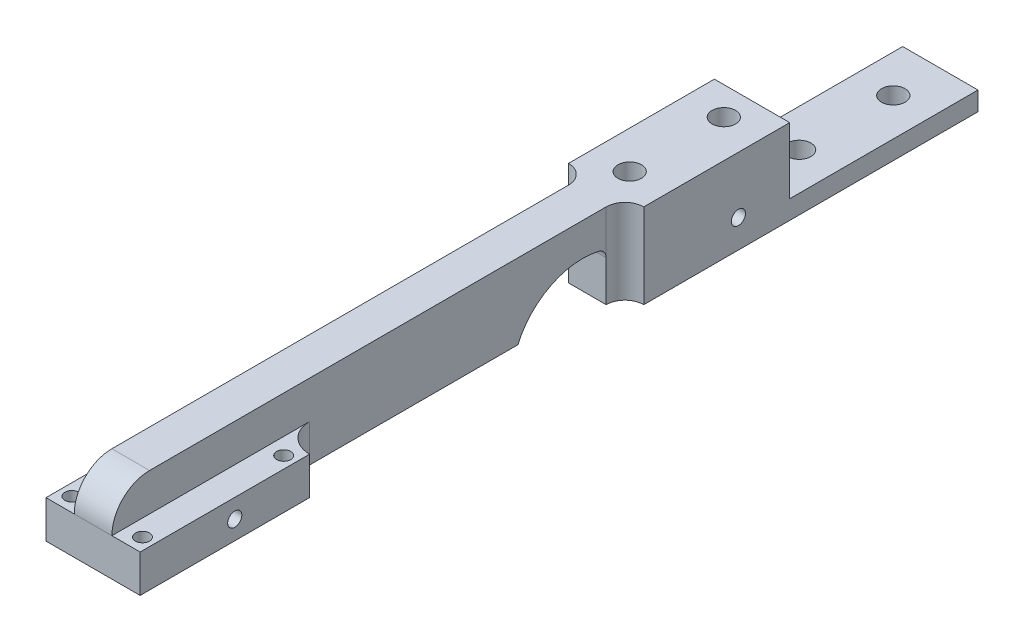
ISO-10303-21;
HEADER;
FILE_DESCRIPTION(('STEP AP214'),'2;1');
FILE_NAME('part.step','',(''),(''),'','','');
FILE_SCHEMA(('AUTOMOTIVE_DESIGN { 1 0 10303 214 1 1 1 1 }'));
ENDSEC;
DATA;
#1=APPLICATION_CONTEXT('core data for automotive mechanical design processes');
#2=APPLICATION_PROTOCOL_DEFINITION('international standard','automotive_design',2000,#1);
#3=PRODUCT_CONTEXT('',#1,'mechanical');
#4=PRODUCT('Part','Part','',(#3));
#5=PRODUCT_RELATED_PRODUCT_CATEGORY('part','',(#4));
#6=PRODUCT_DEFINITION_FORMATION('','',#4);
#7=PRODUCT_DEFINITION_CONTEXT('part definition',#1,'design');
#8=PRODUCT_DEFINITION('design','',#6,#7);
#9=PRODUCT_DEFINITION_SHAPE('','',#8);
#10=(LENGTH_UNIT() NAMED_UNIT(*) SI_UNIT(.MILLI.,.METRE.));
#11=(NAMED_UNIT(*) PLANE_ANGLE_UNIT() SI_UNIT($,.RADIAN.));
#12=(NAMED_UNIT(*) SI_UNIT($,.STERADIAN.) SOLID_ANGLE_UNIT());
#13=UNCERTAINTY_MEASURE_WITH_UNIT(LENGTH_MEASURE(1.E-05),#10,'distance_accuracy_value','');
#14=(GEOMETRIC_REPRESENTATION_CONTEXT(3) GLOBAL_UNCERTAINTY_ASSIGNED_CONTEXT((#13)) GLOBAL_UNIT_ASSIGNED_CONTEXT((#10,
#11,#12)) REPRESENTATION_CONTEXT('',''));
#15=CARTESIAN_POINT('',(0.,0.,0.));
#16=DIRECTION('',(0.,0.,1.));
#17=DIRECTION('',(1.,0.,0.));
#18=AXIS2_PLACEMENT_3D('',#15,#16,#17);
#19=CARTESIAN_POINT('',(0.,0.,0.));
#20=DIRECTION('',(0.,0.,1.));
#21=DIRECTION('',(1.,0.,0.));
#22=AXIS2_PLACEMENT_3D('',#19,#20,#21);
#23=PLANE('',#22);
#24=DIRECTION('',(1.,0.,0.));
#25=VECTOR('',#24,1.);
#26=CARTESIAN_POINT('',(-8.,0.,0.));
#27=LINE('',#26,#25);
#28=CARTESIAN_POINT('',(-8.,0.,0.));
#29=VERTEX_POINT('',#28);
#30=CARTESIAN_POINT('',(8.,0.,0.));
#31=VERTEX_POINT('',#30);
#32=EDGE_CURVE('E337',#29,#31,#27,.T.);
#33=ORIENTED_EDGE('',*,*,#32,.F.);
#34=DIRECTION('',(0.,1.,0.));
#35=VECTOR('',#34,1.);
#36=CARTESIAN_POINT('',(-8.,-4.,0.));
#37=LINE('',#36,#35);
#38=CARTESIAN_POINT('',(-8.,14.,0.));
#39=VERTEX_POINT('',#38);
#40=EDGE_CURVE('E559',#29,#39,#37,.T.);
#41=ORIENTED_EDGE('',*,*,#40,.T.);
#42=DIRECTION('',(-1.,0.,0.));
#43=VECTOR('',#42,1.);
#44=CARTESIAN_POINT('',(4.,14.,0.));
#45=LINE('',#44,#43);
#46=CARTESIAN_POINT('',(8.,14.,0.));
#47=VERTEX_POINT('',#46);
#48=EDGE_CURVE('E546',#47,#39,#45,.T.);
#49=ORIENTED_EDGE('',*,*,#48,.F.);
#50=DIRECTION('',(0.,1.,0.));
#51=VECTOR('',#50,1.);
#52=CARTESIAN_POINT('',(8.,-4.,0.));
#53=LINE('',#52,#51);
#54=EDGE_CURVE('E358',#31,#47,#53,.T.);
#55=ORIENTED_EDGE('',*,*,#54,.F.);
#56=EDGE_LOOP('',(#33,#41,#49,#55));
#57=FACE_BOUND('',#56,.T.);
#58=ADVANCED_FACE('F32',(#57),#23,.F.);
#59=CARTESIAN_POINT('',(10.,-2.,140.));
#60=DIRECTION('',(0.,1.,0.));
#61=DIRECTION('',(-1.,0.,0.));
#62=AXIS2_PLACEMENT_3D('',#59,#60,#61);
#63=PLANE('',#62);
#64=DIRECTION('',(0.,0.,-1.));
#65=VECTOR('',#64,1.);
#66=CARTESIAN_POINT('',(-3.,-2.,79.));
#67=LINE('',#66,#65);
#68=CARTESIAN_POINT('',(-3.,-2.,79.));
#69=VERTEX_POINT('',#68);
#70=CARTESIAN_POINT('',(-3.,-2.,65.));
#71=VERTEX_POINT('',#70);
#72=EDGE_CURVE('E267',#69,#71,#67,.T.);
#73=ORIENTED_EDGE('',*,*,#72,.F.);
#74=CARTESIAN_POINT('',(0.,-2.,79.));
#75=DIRECTION('',(0.,-1.,0.));
#76=DIRECTION('',(1.,0.,0.));
#77=AXIS2_PLACEMENT_3D('',#74,#75,#76);
#78=CIRCLE('',#77,3.);
#79=CARTESIAN_POINT('',(3.,-2.,79.));
#80=VERTEX_POINT('',#79);
#81=EDGE_CURVE('E47',#80,#69,#78,.T.);
#82=ORIENTED_EDGE('',*,*,#81,.F.);
#83=DIRECTION('',(0.,0.,1.));
#84=VECTOR('',#83,1.);
#85=CARTESIAN_POINT('',(3.,-2.,79.));
#86=LINE('',#85,#84);
#87=CARTESIAN_POINT('',(3.,-2.,65.));
#88=VERTEX_POINT('',#87);
#89=EDGE_CURVE('E255',#88,#80,#86,.T.);
#90=ORIENTED_EDGE('',*,*,#89,.F.);
#91=CARTESIAN_POINT('',(0.,-2.,65.));
#92=DIRECTION('',(0.,-1.,0.));
#93=DIRECTION('',(1.,0.,0.));
#94=AXIS2_PLACEMENT_3D('',#91,#92,#93);
#95=CIRCLE('',#94,3.);
#96=EDGE_CURVE('E258',#71,#88,#95,.T.);
#97=ORIENTED_EDGE('',*,*,#96,.F.);
#98=EDGE_LOOP('',(#73,#82,#90,#97));
#99=FACE_BOUND('',#98,.T.);
#100=CARTESIAN_POINT('',(-7.49999999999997,-2.,107.));
#101=DIRECTION('',(0.,1.,0.));
#102=DIRECTION('',(-1.,0.,0.));
#103=AXIS2_PLACEMENT_3D('',#100,#101,#102);
#104=CIRCLE('',#103,1.5);
#105=CARTESIAN_POINT('',(-5.99999999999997,-2.,107.));
#106=VERTEX_POINT('',#105);
#107=CARTESIAN_POINT('',(-7.5,-2.,108.5));
#108=VERTEX_POINT('',#107);
#109=EDGE_CURVE('E322',#106,#108,#104,.T.);
#110=ORIENTED_EDGE('',*,*,#109,.T.);
#111=DIRECTION('',(0.,0.,-1.));
#112=VECTOR('',#111,1.);
#113=CARTESIAN_POINT('',(-7.5,-2.,137.));
#114=LINE('',#113,#112);
#115=CARTESIAN_POINT('',(-7.5,-2.,135.5));
#116=VERTEX_POINT('',#115);
#117=EDGE_CURVE('E274',#116,#108,#114,.T.);
#118=ORIENTED_EDGE('',*,*,#117,.F.);
#119=CARTESIAN_POINT('',(-7.5,-2.,137.));
#120=DIRECTION('',(0.,1.,0.));
#121=DIRECTION('',(-1.,0.,0.));
#122=AXIS2_PLACEMENT_3D('',#119,#120,#121);
#123=CIRCLE('',#122,1.5);
#124=CARTESIAN_POINT('',(-6.,-2.,137.));
#125=VERTEX_POINT('',#124);
#126=EDGE_CURVE('E316',#116,#125,#123,.T.);
#127=ORIENTED_EDGE('',*,*,#126,.T.);
#128=DIRECTION('',(-1.,0.,0.));
#129=VECTOR('',#128,1.);
#130=CARTESIAN_POINT('',(-7.5,-2.,137.));
#131=LINE('',#130,#129);
#132=CARTESIAN_POINT('',(6.,-2.,137.));
#133=VERTEX_POINT('',#132);
#134=EDGE_CURVE('E282',#133,#125,#131,.T.);
#135=ORIENTED_EDGE('',*,*,#134,.F.);
#136=CARTESIAN_POINT('',(7.5,-2.,137.));
#137=DIRECTION('',(0.,1.,0.));
#138=DIRECTION('',(-1.,0.,0.));
#139=AXIS2_PLACEMENT_3D('',#136,#137,#138);
#140=CIRCLE('',#139,1.5);
#141=CARTESIAN_POINT('',(7.5,-2.,135.5));
#142=VERTEX_POINT('',#141);
#143=EDGE_CURVE('E334',#133,#142,#140,.T.);
#144=ORIENTED_EDGE('',*,*,#143,.T.);
#145=DIRECTION('',(0.,0.,1.));
#146=VECTOR('',#145,1.);
#147=CARTESIAN_POINT('',(7.5,-2.,137.));
#148=LINE('',#147,#146);
#149=CARTESIAN_POINT('',(7.5,-2.,108.5));
#150=VERTEX_POINT('',#149);
#151=EDGE_CURVE('E293',#150,#142,#148,.T.);
#152=ORIENTED_EDGE('',*,*,#151,.F.);
#153=CARTESIAN_POINT('',(7.5,-2.,107.));
#154=DIRECTION('',(0.,1.,0.));
#155=DIRECTION('',(-1.,0.,0.));
#156=AXIS2_PLACEMENT_3D('',#153,#154,#155);
#157=CIRCLE('',#156,1.5);
#158=CARTESIAN_POINT('',(6.,-2.,107.));
#159=VERTEX_POINT('',#158);
#160=EDGE_CURVE('E328',#150,#159,#157,.T.);
#161=ORIENTED_EDGE('',*,*,#160,.T.);
#162=DIRECTION('',(1.,0.,0.));
#163=VECTOR('',#162,1.);
#164=CARTESIAN_POINT('',(-7.5,-2.,107.));
#165=LINE('',#164,#163);
#166=EDGE_CURVE('E291',#106,#159,#165,.T.);
#167=ORIENTED_EDGE('',*,*,#166,.F.);
#168=EDGE_LOOP('',(#110,#118,#127,#135,#144,#152,#161,#167));
#169=FACE_BOUND('',#168,.T.);
#170=DIRECTION('',(0.,0.,-1.));
#171=VECTOR('',#170,1.);
#172=CARTESIAN_POINT('',(-4.,-2.,0.));
#173=LINE('',#172,#171);
#174=CARTESIAN_POINT('',(-3.99999999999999,-2.,98.));
#175=VERTEX_POINT('',#174);
#176=CARTESIAN_POINT('',(-4.,-1.99999999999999,53.7477270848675));
#177=VERTEX_POINT('',#176);
#178=EDGE_CURVE('E525',#175,#177,#173,.T.);
#179=ORIENTED_EDGE('',*,*,#178,.T.);
#180=DIRECTION('',(1.,0.,0.));
#181=VECTOR('',#180,1.);
#182=CARTESIAN_POINT('',(-10.000025,-1.99999999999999,53.7477270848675));
#183=LINE('',#182,#181);
#184=CARTESIAN_POINT('',(4.,-1.99999999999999,53.7477270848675));
#185=VERTEX_POINT('',#184);
#186=EDGE_CURVE('E576',#177,#185,#183,.T.);
#187=ORIENTED_EDGE('',*,*,#186,.T.);
#188=DIRECTION('',(0.,0.,1.));
#189=VECTOR('',#188,1.);
#190=CARTESIAN_POINT('',(4.,-2.,0.));
#191=LINE('',#190,#189);
#192=CARTESIAN_POINT('',(4.00000000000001,-2.,98.));
#193=VERTEX_POINT('',#192);
#194=EDGE_CURVE('E515',#185,#193,#191,.T.);
#195=ORIENTED_EDGE('',*,*,#194,.T.);
#196=CARTESIAN_POINT('',(10.,-2.,98.));
#197=DIRECTION('',(0.,1.,0.));
#198=DIRECTION('',(0.,0.,1.));
#199=AXIS2_PLACEMENT_3D('',#196,#197,#198);
#200=CIRCLE('',#199,6.);
#201=CARTESIAN_POINT('',(10.,-2.,104.));
#202=VERTEX_POINT('',#201);
#203=EDGE_CURVE('E518',#193,#202,#200,.T.);
#204=ORIENTED_EDGE('',*,*,#203,.T.);
#205=DIRECTION('',(0.,0.,-1.));
#206=VECTOR('',#205,1.);
#207=CARTESIAN_POINT('',(10.,-2.,140.));
#208=LINE('',#207,#206);
#209=CARTESIAN_POINT('',(10.,-2.,140.));
#210=VERTEX_POINT('',#209);
#211=EDGE_CURVE('E497',#210,#202,#208,.T.);
#212=ORIENTED_EDGE('',*,*,#211,.F.);
#213=DIRECTION('',(1.,0.,0.));
#214=VECTOR('',#213,1.);
#215=CARTESIAN_POINT('',(10.,-2.,140.));
#216=LINE('',#215,#214);
#217=CARTESIAN_POINT('',(-10.,-2.,140.));
#218=VERTEX_POINT('',#217);
#219=EDGE_CURVE('E484',#218,#210,#216,.T.);
#220=ORIENTED_EDGE('',*,*,#219,.F.);
#221=DIRECTION('',(0.,0.,-1.));
#222=VECTOR('',#221,1.);
#223=CARTESIAN_POINT('',(-10.,-2.,140.));
#224=LINE('',#223,#222);
#225=CARTESIAN_POINT('',(-9.99999999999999,-2.,104.));
#226=VERTEX_POINT('',#225);
#227=EDGE_CURVE('E500',#218,#226,#224,.T.);
#228=ORIENTED_EDGE('',*,*,#227,.T.);
#229=CARTESIAN_POINT('',(-9.99999999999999,-2.,98.));
#230=DIRECTION('',(0.,1.,0.));
#231=DIRECTION('',(0.,0.,-1.));
#232=AXIS2_PLACEMENT_3D('',#229,#230,#231);
#233=CIRCLE('',#232,6.);
#234=EDGE_CURVE('E522',#226,#175,#233,.T.);
#235=ORIENTED_EDGE('',*,*,#234,.T.);
#236=EDGE_LOOP('',(#179,#187,#195,#204,#212,#220,#228,#235));
#237=FACE_BOUND('',#236,.T.);
#238=ADVANCED_FACE('F389',(#99,#169,#237),#63,.F.);
#239=CARTESIAN_POINT('',(10.,6.,140.));
#240=DIRECTION('',(0.,-1.,0.));
#241=DIRECTION('',(1.,0.,0.));
#242=AXIS2_PLACEMENT_3D('',#239,#240,#241);
#243=PLANE('',#242);
#244=CARTESIAN_POINT('',(7.5,6.,107.));
#245=DIRECTION('',(0.,1.,0.));
#246=DIRECTION('',(0.,0.,1.));
#247=AXIS2_PLACEMENT_3D('',#244,#245,#246);
#248=CIRCLE('',#247,1.5);
#249=CARTESIAN_POINT('',(7.5,6.,108.5));
#250=VERTEX_POINT('',#249);
#251=EDGE_CURVE('E325',#250,#250,#248,.T.);
#252=ORIENTED_EDGE('',*,*,#251,.F.);
#253=EDGE_LOOP('',(#252));
#254=FACE_BOUND('',#253,.T.);
#255=CARTESIAN_POINT('',(7.5,6.,137.));
#256=DIRECTION('',(0.,1.,0.));
#257=DIRECTION('',(0.,0.,1.));
#258=AXIS2_PLACEMENT_3D('',#255,#256,#257);
#259=CIRCLE('',#258,1.5);
#260=CARTESIAN_POINT('',(7.5,6.,138.5));
#261=VERTEX_POINT('',#260);
#262=EDGE_CURVE('E331',#261,#261,#259,.T.);
#263=ORIENTED_EDGE('',*,*,#262,.F.);
#264=EDGE_LOOP('',(#263));
#265=FACE_BOUND('',#264,.T.);
#266=DIRECTION('',(0.,0.,-1.));
#267=VECTOR('',#266,1.);
#268=CARTESIAN_POINT('',(4.,6.,140.));
#269=LINE('',#268,#267);
#270=CARTESIAN_POINT('',(4.,6.,140.));
#271=VERTEX_POINT('',#270);
#272=CARTESIAN_POINT('',(4.00000000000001,6.,98.));
#273=VERTEX_POINT('',#272);
#274=EDGE_CURVE('E462',#271,#273,#269,.T.);
#275=ORIENTED_EDGE('',*,*,#274,.F.);
#276=DIRECTION('',(-1.,0.,0.));
#277=VECTOR('',#276,1.);
#278=CARTESIAN_POINT('',(10.,6.,140.));
#279=LINE('',#278,#277);
#280=CARTESIAN_POINT('',(10.,6.,140.));
#281=VERTEX_POINT('',#280);
#282=EDGE_CURVE('E465',#281,#271,#279,.T.);
#283=ORIENTED_EDGE('',*,*,#282,.F.);
#284=DIRECTION('',(0.,0.,-1.));
#285=VECTOR('',#284,1.);
#286=CARTESIAN_POINT('',(10.,6.,140.));
#287=LINE('',#286,#285);
#288=CARTESIAN_POINT('',(10.,6.,104.));
#289=VERTEX_POINT('',#288);
#290=EDGE_CURVE('E374',#281,#289,#287,.T.);
#291=ORIENTED_EDGE('',*,*,#290,.T.);
#292=CARTESIAN_POINT('',(10.,6.,98.));
#293=DIRECTION('',(0.,1.,0.));
#294=DIRECTION('',(0.,0.,1.));
#295=AXIS2_PLACEMENT_3D('',#292,#293,#294);
#296=CIRCLE('',#295,6.);
#297=EDGE_CURVE('E467',#273,#289,#296,.T.);
#298=ORIENTED_EDGE('',*,*,#297,.F.);
#299=EDGE_LOOP('',(#275,#283,#291,#298));
#300=FACE_BOUND('',#299,.T.);
#301=ADVANCED_FACE('F433',(#254,#265,#300),#243,.F.);
#302=CARTESIAN_POINT('',(10.,-2.,140.));
#303=DIRECTION('',(-1.,0.,0.));
#304=DIRECTION('',(0.,0.,1.));
#305=AXIS2_PLACEMENT_3D('',#302,#303,#304);
#306=PLANE('',#305);
#307=CARTESIAN_POINT('',(10.,2.,119.9));
#308=DIRECTION('',(1.,0.,0.));
#309=DIRECTION('',(0.,0.,-1.));
#310=AXIS2_PLACEMENT_3D('',#307,#308,#309);
#311=CIRCLE('',#310,1.5);
#312=CARTESIAN_POINT('',(10.,2.,118.4));
#313=VERTEX_POINT('',#312);
#314=EDGE_CURVE('E1029',#313,#313,#311,.T.);
#315=ORIENTED_EDGE('',*,*,#314,.F.);
#316=EDGE_LOOP('',(#315));
#317=FACE_BOUND('',#316,.T.);
#318=ORIENTED_EDGE('',*,*,#211,.T.);
#319=DIRECTION('',(0.,1.,0.));
#320=VECTOR('',#319,1.);
#321=CARTESIAN_POINT('',(10.,-2.,104.));
#322=LINE('',#321,#320);
#323=EDGE_CURVE('E509',#202,#289,#322,.T.);
#324=ORIENTED_EDGE('',*,*,#323,.T.);
#325=ORIENTED_EDGE('',*,*,#290,.F.);
#326=DIRECTION('',(0.,1.,0.));
#327=VECTOR('',#326,1.);
#328=CARTESIAN_POINT('',(10.,-2.,140.));
#329=LINE('',#328,#327);
#330=EDGE_CURVE('E479',#210,#281,#329,.T.);
#331=ORIENTED_EDGE('',*,*,#330,.F.);
#332=EDGE_LOOP('',(#318,#324,#325,#331));
#333=FACE_BOUND('',#332,.T.);
#334=ADVANCED_FACE('F34',(#317,#333),#306,.F.);
#335=CARTESIAN_POINT('',(-7.5,6.,137.));
#336=DIRECTION('',(0.,1.,0.));
#337=DIRECTION('',(0.,0.,-1.));
#338=AXIS2_PLACEMENT_3D('',#335,#336,#337);
#339=CIRCLE('',#338,1.5);
#340=CARTESIAN_POINT('',(-7.5,6.,135.5));
#341=VERTEX_POINT('',#340);
#342=EDGE_CURVE('E313',#341,#341,#339,.T.);
#343=ORIENTED_EDGE('',*,*,#342,.F.);
#344=EDGE_LOOP('',(#343));
#345=FACE_BOUND('',#344,.T.);
#346=CARTESIAN_POINT('',(-7.49999999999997,6.,107.));
#347=DIRECTION('',(0.,1.,0.));
#348=DIRECTION('',(0.,0.,-1.));
#349=AXIS2_PLACEMENT_3D('',#346,#347,#348);
#350=CIRCLE('',#349,1.5);
#351=CARTESIAN_POINT('',(-7.49999999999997,6.,105.5));
#352=VERTEX_POINT('',#351);
#353=EDGE_CURVE('E319',#352,#352,#350,.T.);
#354=ORIENTED_EDGE('',*,*,#353,.F.);
#355=EDGE_LOOP('',(#354));
#356=FACE_BOUND('',#355,.T.);
#357=CARTESIAN_POINT('',(-4.,6.,140.));
#358=VERTEX_POINT('',#357);
#359=CARTESIAN_POINT('',(-10.,6.,140.));
#360=VERTEX_POINT('',#359);
#361=EDGE_CURVE('E482',#358,#360,#279,.T.);
#362=ORIENTED_EDGE('',*,*,#361,.F.);
#363=DIRECTION('',(0.,0.,-1.));
#364=VECTOR('',#363,1.);
#365=CARTESIAN_POINT('',(-4.,6.,140.));
#366=LINE('',#365,#364);
#367=CARTESIAN_POINT('',(-4.,6.,98.));
#368=VERTEX_POINT('',#367);
#369=EDGE_CURVE('E552',#358,#368,#366,.T.);
#370=ORIENTED_EDGE('',*,*,#369,.T.);
#371=CARTESIAN_POINT('',(-9.99999999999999,6.,98.));
#372=DIRECTION('',(0.,1.,0.));
#373=DIRECTION('',(0.,0.,-1.));
#374=AXIS2_PLACEMENT_3D('',#371,#372,#373);
#375=CIRCLE('',#374,6.);
#376=CARTESIAN_POINT('',(-9.99999999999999,6.,104.));
#377=VERTEX_POINT('',#376);
#378=EDGE_CURVE('E517',#377,#368,#375,.T.);
#379=ORIENTED_EDGE('',*,*,#378,.F.);
#380=DIRECTION('',(0.,0.,-1.));
#381=VECTOR('',#380,1.);
#382=CARTESIAN_POINT('',(-10.,6.,140.));
#383=LINE('',#382,#381);
#384=EDGE_CURVE('E502',#360,#377,#383,.T.);
#385=ORIENTED_EDGE('',*,*,#384,.F.);
#386=EDGE_LOOP('',(#362,#370,#379,#385));
#387=FACE_BOUND('',#386,.T.);
#388=ADVANCED_FACE('F442',(#345,#356,#387),#243,.F.);
#389=CARTESIAN_POINT('',(-10.,-2.,140.));
#390=DIRECTION('',(1.,0.,0.));
#391=DIRECTION('',(0.,0.,-1.));
#392=AXIS2_PLACEMENT_3D('',#389,#390,#391);
#393=PLANE('',#392);
#394=ORIENTED_EDGE('',*,*,#384,.T.);
#395=DIRECTION('',(0.,1.,0.));
#396=VECTOR('',#395,1.);
#397=CARTESIAN_POINT('',(-9.99999999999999,-2.,104.));
#398=LINE('',#397,#396);
#399=EDGE_CURVE('E527',#226,#377,#398,.T.);
#400=ORIENTED_EDGE('',*,*,#399,.F.);
#401=ORIENTED_EDGE('',*,*,#227,.F.);
#402=DIRECTION('',(0.,-1.,0.));
#403=VECTOR('',#402,1.);
#404=CARTESIAN_POINT('',(-10.,-2.,140.));
#405=LINE('',#404,#403);
#406=EDGE_CURVE('E481',#360,#218,#405,.T.);
#407=ORIENTED_EDGE('',*,*,#406,.F.);
#408=EDGE_LOOP('',(#394,#400,#401,#407));
#409=FACE_BOUND('',#408,.T.);
#410=ADVANCED_FACE('F440',(#409),#393,.F.);
#411=CARTESIAN_POINT('',(0.,0.,140.));
#412=DIRECTION('',(0.,0.,1.));
#413=DIRECTION('',(1.,0.,0.));
#414=AXIS2_PLACEMENT_3D('',#411,#412,#413);
#415=PLANE('',#414);
#416=ORIENTED_EDGE('',*,*,#330,.T.);
#417=ORIENTED_EDGE('',*,*,#282,.T.);
#418=DIRECTION('',(-1.,0.,0.));
#419=VECTOR('',#418,1.);
#420=CARTESIAN_POINT('',(4.,6.,140.));
#421=LINE('',#420,#419);
#422=EDGE_CURVE('E477',#271,#358,#421,.T.);
#423=ORIENTED_EDGE('',*,*,#422,.T.);
#424=ORIENTED_EDGE('',*,*,#361,.T.);
#425=ORIENTED_EDGE('',*,*,#406,.T.);
#426=ORIENTED_EDGE('',*,*,#219,.T.);
#427=EDGE_LOOP('',(#416,#417,#423,#424,#425,#426));
#428=FACE_BOUND('',#427,.T.);
#429=ADVANCED_FACE('F437',(#428),#415,.T.);
#430=CARTESIAN_POINT('',(-4.,-2.,0.));
#431=DIRECTION('',(1.,0.,0.));
#432=DIRECTION('',(0.,0.,-1.));
#433=AXIS2_PLACEMENT_3D('',#430,#431,#432);
#434=PLANE('',#433);
#435=DIRECTION('',(0.,0.,1.));
#436=VECTOR('',#435,1.);
#437=CARTESIAN_POINT('',(-4.,14.,132.));
#438=LINE('',#437,#436);
#439=CARTESIAN_POINT('',(-4.,14.,35.));
#440=VERTEX_POINT('',#439);
#441=CARTESIAN_POINT('',(-4.,14.,132.));
#442=VERTEX_POINT('',#441);
#443=EDGE_CURVE('E557',#440,#442,#438,.T.);
#444=ORIENTED_EDGE('',*,*,#443,.F.);
#445=DIRECTION('',(0.,1.,0.));
#446=VECTOR('',#445,1.);
#447=CARTESIAN_POINT('',(-4.,-4.,35.));
#448=LINE('',#447,#446);
#449=CARTESIAN_POINT('',(-4.,4.64911064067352,35.));
#450=VERTEX_POINT('',#449);
#451=EDGE_CURVE('E609',#450,#440,#448,.T.);
#452=ORIENTED_EDGE('',*,*,#451,.F.);
#453=CARTESIAN_POINT('',(-4.,4.64911064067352,37.));
#454=DIRECTION('',(1.,0.,0.));
#455=DIRECTION('',(0.,0.,-1.));
#456=AXIS2_PLACEMENT_3D('',#453,#454,#455);
#457=CIRCLE('',#456,2.);
#458=CARTESIAN_POINT('',(-4.,6.5951276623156,36.5384615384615));
#459=VERTEX_POINT('',#458);
#460=EDGE_CURVE('E585',#450,#459,#457,.T.);
#461=ORIENTED_EDGE('',*,*,#460,.T.);
#462=CARTESIAN_POINT('',(-4.,-8.,40.));
#463=DIRECTION('',(1.,0.,0.));
#464=DIRECTION('',(0.,0.,-1.));
#465=AXIS2_PLACEMENT_3D('',#462,#463,#464);
#466=CIRCLE('',#465,15.);
#467=EDGE_CURVE('E553',#459,#177,#466,.T.);
#468=ORIENTED_EDGE('',*,*,#467,.T.);
#469=ORIENTED_EDGE('',*,*,#178,.F.);
#470=DIRECTION('',(0.,1.,0.));
#471=VECTOR('',#470,1.);
#472=CARTESIAN_POINT('',(-3.99999999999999,-2.,98.));
#473=LINE('',#472,#471);
#474=EDGE_CURVE('E528',#175,#368,#473,.T.);
#475=ORIENTED_EDGE('',*,*,#474,.T.);
#476=ORIENTED_EDGE('',*,*,#369,.F.);
#477=CARTESIAN_POINT('',(-4.,6.,132.));
#478=DIRECTION('',(1.,0.,0.));
#479=DIRECTION('',(0.,0.,1.));
#480=AXIS2_PLACEMENT_3D('',#477,#478,#479);
#481=CIRCLE('',#480,8.);
#482=EDGE_CURVE('E549',#442,#358,#481,.T.);
#483=ORIENTED_EDGE('',*,*,#482,.F.);
#484=EDGE_LOOP('',(#444,#452,#461,#468,#469,#475,#476,#483));
#485=FACE_BOUND('',#484,.T.);
#486=ADVANCED_FACE('F605',(#485),#434,.F.);
#487=CARTESIAN_POINT('',(-9.99999999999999,-2.,98.));
#488=DIRECTION('',(0.,1.,0.));
#489=DIRECTION('',(0.,0.,1.));
#490=AXIS2_PLACEMENT_3D('',#487,#488,#489);
#491=CYLINDRICAL_SURFACE('',#490,6.);
#492=ORIENTED_EDGE('',*,*,#378,.T.);
#493=ORIENTED_EDGE('',*,*,#474,.F.);
#494=ORIENTED_EDGE('',*,*,#234,.F.);
#495=ORIENTED_EDGE('',*,*,#399,.T.);
#496=EDGE_LOOP('',(#492,#493,#494,#495));
#497=FACE_BOUND('',#496,.T.);
#498=ADVANCED_FACE('F693',(#497),#491,.F.);
#499=CARTESIAN_POINT('',(10.,-2.,98.));
#500=DIRECTION('',(0.,1.,0.));
#501=DIRECTION('',(0.,0.,1.));
#502=AXIS2_PLACEMENT_3D('',#499,#500,#501);
#503=CYLINDRICAL_SURFACE('',#502,6.);
#504=ORIENTED_EDGE('',*,*,#297,.T.);
#505=ORIENTED_EDGE('',*,*,#323,.F.);
#506=ORIENTED_EDGE('',*,*,#203,.F.);
#507=DIRECTION('',(0.,1.,0.));
#508=VECTOR('',#507,1.);
#509=CARTESIAN_POINT('',(4.00000000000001,-2.,98.));
#510=LINE('',#509,#508);
#511=EDGE_CURVE('E514',#193,#273,#510,.T.);
#512=ORIENTED_EDGE('',*,*,#511,.T.);
#513=EDGE_LOOP('',(#504,#505,#506,#512));
#514=FACE_BOUND('',#513,.T.);
#515=ADVANCED_FACE('F597',(#514),#503,.F.);
#516=CARTESIAN_POINT('',(4.,-2.,0.));
#517=DIRECTION('',(-1.,0.,0.));
#518=DIRECTION('',(0.,0.,1.));
#519=AXIS2_PLACEMENT_3D('',#516,#517,#518);
#520=PLANE('',#519);
#521=CARTESIAN_POINT('',(4.,4.64911064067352,37.));
#522=DIRECTION('',(1.,0.,0.));
#523=DIRECTION('',(0.,0.,-1.));
#524=AXIS2_PLACEMENT_3D('',#521,#522,#523);
#525=CIRCLE('',#524,2.);
#526=CARTESIAN_POINT('',(4.,4.64911064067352,35.));
#527=VERTEX_POINT('',#526);
#528=CARTESIAN_POINT('',(4.,6.5951276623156,36.5384615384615));
#529=VERTEX_POINT('',#528);
#530=EDGE_CURVE('E570',#527,#529,#525,.T.);
#531=ORIENTED_EDGE('',*,*,#530,.F.);
#532=DIRECTION('',(0.,1.,0.));
#533=VECTOR('',#532,1.);
#534=CARTESIAN_POINT('',(4.00000000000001,-4.,35.));
#535=LINE('',#534,#533);
#536=CARTESIAN_POINT('',(4.,14.,35.));
#537=VERTEX_POINT('',#536);
#538=EDGE_CURVE('E613',#527,#537,#535,.T.);
#539=ORIENTED_EDGE('',*,*,#538,.T.);
#540=DIRECTION('',(0.,0.,1.));
#541=VECTOR('',#540,1.);
#542=CARTESIAN_POINT('',(4.,14.,132.));
#543=LINE('',#542,#541);
#544=CARTESIAN_POINT('',(4.,14.,132.));
#545=VERTEX_POINT('',#544);
#546=EDGE_CURVE('E471',#537,#545,#543,.T.);
#547=ORIENTED_EDGE('',*,*,#546,.T.);
#548=CARTESIAN_POINT('',(4.,6.,132.));
#549=DIRECTION('',(1.,0.,0.));
#550=DIRECTION('',(0.,0.,1.));
#551=AXIS2_PLACEMENT_3D('',#548,#549,#550);
#552=CIRCLE('',#551,8.);
#553=EDGE_CURVE('E472',#545,#271,#552,.T.);
#554=ORIENTED_EDGE('',*,*,#553,.T.);
#555=ORIENTED_EDGE('',*,*,#274,.T.);
#556=ORIENTED_EDGE('',*,*,#511,.F.);
#557=ORIENTED_EDGE('',*,*,#194,.F.);
#558=CARTESIAN_POINT('',(4.,-8.,40.));
#559=DIRECTION('',(1.,0.,0.));
#560=DIRECTION('',(0.,0.,-1.));
#561=AXIS2_PLACEMENT_3D('',#558,#559,#560);
#562=CIRCLE('',#561,15.);
#563=EDGE_CURVE('E573',#529,#185,#562,.T.);
#564=ORIENTED_EDGE('',*,*,#563,.F.);
#565=EDGE_LOOP('',(#531,#539,#547,#554,#555,#556,#557,#564));
#566=FACE_BOUND('',#565,.T.);
#567=ADVANCED_FACE('F600',(#566),#520,.F.);
#568=CARTESIAN_POINT('',(4.,6.,132.));
#569=DIRECTION('',(-1.,0.,0.));
#570=DIRECTION('',(0.,0.,1.));
#571=AXIS2_PLACEMENT_3D('',#568,#569,#570);
#572=CYLINDRICAL_SURFACE('',#571,8.);
#573=ORIENTED_EDGE('',*,*,#482,.T.);
#574=ORIENTED_EDGE('',*,*,#422,.F.);
#575=ORIENTED_EDGE('',*,*,#553,.F.);
#576=DIRECTION('',(-1.,0.,0.));
#577=VECTOR('',#576,1.);
#578=CARTESIAN_POINT('',(4.,14.,132.));
#579=LINE('',#578,#577);
#580=EDGE_CURVE('E670',#545,#442,#579,.T.);
#581=ORIENTED_EDGE('',*,*,#580,.T.);
#582=EDGE_LOOP('',(#573,#574,#575,#581));
#583=FACE_BOUND('',#582,.T.);
#584=ADVANCED_FACE('F679',(#583),#572,.T.);
#585=CARTESIAN_POINT('',(4.,14.,132.));
#586=DIRECTION('',(0.,-1.,0.));
#587=DIRECTION('',(0.,0.,-1.));
#588=AXIS2_PLACEMENT_3D('',#585,#586,#587);
#589=PLANE('',#588);
#590=CARTESIAN_POINT('',(0.,14.,6.00000000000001));
#591=DIRECTION('',(0.,1.,0.));
#592=DIRECTION('',(0.,0.,1.));
#593=AXIS2_PLACEMENT_3D('',#590,#591,#592);
#594=CIRCLE('',#593,2.5);
#595=CARTESIAN_POINT('',(0.,14.,8.50000000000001));
#596=VERTEX_POINT('',#595);
#597=EDGE_CURVE('E1050',#596,#596,#594,.T.);
#598=ORIENTED_EDGE('',*,*,#597,.F.);
#599=EDGE_LOOP('',(#598));
#600=FACE_BOUND('',#599,.T.);
#601=CARTESIAN_POINT('',(0.,14.,26.));
#602=DIRECTION('',(0.,1.,0.));
#603=DIRECTION('',(0.,0.,1.));
#604=AXIS2_PLACEMENT_3D('',#601,#602,#603);
#605=CIRCLE('',#604,2.5);
#606=CARTESIAN_POINT('',(0.,14.,28.5));
#607=VERTEX_POINT('',#606);
#608=EDGE_CURVE('E261',#607,#607,#605,.T.);
#609=ORIENTED_EDGE('',*,*,#608,.F.);
#610=EDGE_LOOP('',(#609));
#611=FACE_BOUND('',#610,.T.);
#612=ORIENTED_EDGE('',*,*,#546,.F.);
#613=CARTESIAN_POINT('',(8.,14.,35.));
#614=DIRECTION('',(0.,-1.,0.));
#615=DIRECTION('',(0.,0.,-1.));
#616=AXIS2_PLACEMENT_3D('',#613,#614,#615);
#617=CIRCLE('',#616,4.);
#618=CARTESIAN_POINT('',(8.,14.,31.));
#619=VERTEX_POINT('',#618);
#620=EDGE_CURVE('E621',#537,#619,#617,.T.);
#621=ORIENTED_EDGE('',*,*,#620,.T.);
#622=DIRECTION('',(0.,0.,-1.));
#623=VECTOR('',#622,1.);
#624=CARTESIAN_POINT('',(8.,14.,0.));
#625=LINE('',#624,#623);
#626=EDGE_CURVE('E627',#619,#47,#625,.T.);
#627=ORIENTED_EDGE('',*,*,#626,.T.);
#628=ORIENTED_EDGE('',*,*,#48,.T.);
#629=DIRECTION('',(0.,0.,1.));
#630=VECTOR('',#629,1.);
#631=CARTESIAN_POINT('',(-8.,14.,0.));
#632=LINE('',#631,#630);
#633=CARTESIAN_POINT('',(-8.,14.,31.));
#634=VERTEX_POINT('',#633);
#635=EDGE_CURVE('E368',#39,#634,#632,.T.);
#636=ORIENTED_EDGE('',*,*,#635,.T.);
#637=CARTESIAN_POINT('',(-8.,14.,35.));
#638=DIRECTION('',(0.,-1.,0.));
#639=DIRECTION('',(0.,0.,1.));
#640=AXIS2_PLACEMENT_3D('',#637,#638,#639);
#641=CIRCLE('',#640,4.);
#642=EDGE_CURVE('E631',#634,#440,#641,.T.);
#643=ORIENTED_EDGE('',*,*,#642,.T.);
#644=ORIENTED_EDGE('',*,*,#443,.T.);
#645=ORIENTED_EDGE('',*,*,#580,.F.);
#646=EDGE_LOOP('',(#612,#621,#627,#628,#636,#643,#644,#645));
#647=FACE_BOUND('',#646,.T.);
#648=ADVANCED_FACE('F667',(#600,#611,#647),#589,.F.);
#649=CARTESIAN_POINT('',(-10.000025,-8.,40.));
#650=DIRECTION('',(1.,0.,0.));
#651=DIRECTION('',(0.,0.,-1.));
#652=AXIS2_PLACEMENT_3D('',#649,#650,#651);
#653=CYLINDRICAL_SURFACE('',#652,15.);
#654=DIRECTION('',(1.,0.,0.));
#655=VECTOR('',#654,1.);
#656=CARTESIAN_POINT('',(-10.000025,6.5951276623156,36.5384615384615));
#657=LINE('',#656,#655);
#658=EDGE_CURVE('E580',#459,#529,#657,.T.);
#659=ORIENTED_EDGE('',*,*,#658,.T.);
#660=ORIENTED_EDGE('',*,*,#563,.T.);
#661=ORIENTED_EDGE('',*,*,#186,.F.);
#662=ORIENTED_EDGE('',*,*,#467,.F.);
#663=EDGE_LOOP('',(#659,#660,#661,#662));
#664=FACE_BOUND('',#663,.T.);
#665=ADVANCED_FACE('F603',(#664),#653,.F.);
#666=CARTESIAN_POINT('',(-10.000025,4.64911064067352,37.));
#667=DIRECTION('',(1.,0.,0.));
#668=DIRECTION('',(0.,0.,-1.));
#669=AXIS2_PLACEMENT_3D('',#666,#667,#668);
#670=CYLINDRICAL_SURFACE('',#669,2.);
#671=DIRECTION('',(1.,0.,0.));
#672=VECTOR('',#671,1.);
#673=CARTESIAN_POINT('',(-10.000025,4.64911064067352,35.));
#674=LINE('',#673,#672);
#675=EDGE_CURVE('E575',#450,#527,#674,.T.);
#676=ORIENTED_EDGE('',*,*,#675,.T.);
#677=ORIENTED_EDGE('',*,*,#530,.T.);
#678=ORIENTED_EDGE('',*,*,#658,.F.);
#679=ORIENTED_EDGE('',*,*,#460,.F.);
#680=EDGE_LOOP('',(#676,#677,#678,#679));
#681=FACE_BOUND('',#680,.T.);
#682=ADVANCED_FACE('F611',(#681),#670,.F.);
#683=CARTESIAN_POINT('',(-10.000025,-2.,35.));
#684=DIRECTION('',(0.,0.,-1.));
#685=DIRECTION('',(-1.,0.,0.));
#686=AXIS2_PLACEMENT_3D('',#683,#684,#685);
#687=PLANE('',#686);
#688=DIRECTION('',(0.,1.,0.));
#689=VECTOR('',#688,1.);
#690=CARTESIAN_POINT('',(-4.,-2.,35.));
#691=LINE('',#690,#689);
#692=CARTESIAN_POINT('',(-4.,-4.,35.));
#693=VERTEX_POINT('',#692);
#694=EDGE_CURVE('E579',#693,#450,#691,.T.);
#695=ORIENTED_EDGE('',*,*,#694,.F.);
#696=DIRECTION('',(1.,0.,0.));
#697=VECTOR('',#696,1.);
#698=CARTESIAN_POINT('',(-4.,-4.,35.));
#699=LINE('',#698,#697);
#700=CARTESIAN_POINT('',(4.00000000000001,-4.,35.));
#701=VERTEX_POINT('',#700);
#702=EDGE_CURVE('E639',#693,#701,#699,.T.);
#703=ORIENTED_EDGE('',*,*,#702,.T.);
#704=DIRECTION('',(0.,1.,0.));
#705=VECTOR('',#704,1.);
#706=CARTESIAN_POINT('',(4.,-2.,35.));
#707=LINE('',#706,#705);
#708=EDGE_CURVE('E567',#701,#527,#707,.T.);
#709=ORIENTED_EDGE('',*,*,#708,.T.);
#710=ORIENTED_EDGE('',*,*,#675,.F.);
#711=EDGE_LOOP('',(#695,#703,#709,#710));
#712=FACE_BOUND('',#711,.T.);
#713=ADVANCED_FACE('F726',(#712),#687,.F.);
#714=CARTESIAN_POINT('',(8.,-4.,0.));
#715=DIRECTION('',(1.,0.,0.));
#716=DIRECTION('',(0.,0.,-1.));
#717=AXIS2_PLACEMENT_3D('',#714,#715,#716);
#718=PLANE('',#717);
#719=CARTESIAN_POINT('',(8.,2.,10.9));
#720=DIRECTION('',(1.,0.,0.));
#721=DIRECTION('',(0.,0.,-1.));
#722=AXIS2_PLACEMENT_3D('',#719,#720,#721);
#723=CIRCLE('',#722,1.5);
#724=CARTESIAN_POINT('',(8.,2.,9.40000000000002));
#725=VERTEX_POINT('',#724);
#726=EDGE_CURVE('E1030',#725,#725,#723,.T.);
#727=ORIENTED_EDGE('',*,*,#726,.F.);
#728=EDGE_LOOP('',(#727));
#729=FACE_BOUND('',#728,.T.);
#730=ORIENTED_EDGE('',*,*,#626,.F.);
#731=DIRECTION('',(0.,1.,0.));
#732=VECTOR('',#731,1.);
#733=CARTESIAN_POINT('',(8.,-4.,31.));
#734=LINE('',#733,#732);
#735=CARTESIAN_POINT('',(8.,-4.,31.));
#736=VERTEX_POINT('',#735);
#737=EDGE_CURVE('E622',#736,#619,#734,.T.);
#738=ORIENTED_EDGE('',*,*,#737,.F.);
#739=DIRECTION('',(0.,0.,-1.));
#740=VECTOR('',#739,1.);
#741=CARTESIAN_POINT('',(8.,-4.,0.));
#742=LINE('',#741,#740);
#743=CARTESIAN_POINT('',(8.,-4.,-40.));
#744=VERTEX_POINT('',#743);
#745=EDGE_CURVE('E562',#736,#744,#742,.T.);
#746=ORIENTED_EDGE('',*,*,#745,.T.);
#747=DIRECTION('',(0.,-1.,0.));
#748=VECTOR('',#747,1.);
#749=CARTESIAN_POINT('',(8.,-4.,-40.));
#750=LINE('',#749,#748);
#751=CARTESIAN_POINT('',(8.,0.,-40.));
#752=VERTEX_POINT('',#751);
#753=EDGE_CURVE('E343',#752,#744,#750,.T.);
#754=ORIENTED_EDGE('',*,*,#753,.F.);
#755=DIRECTION('',(0.,0.,1.));
#756=VECTOR('',#755,1.);
#757=CARTESIAN_POINT('',(8.,0.,-40.));
#758=LINE('',#757,#756);
#759=EDGE_CURVE('E349',#752,#31,#758,.T.);
#760=ORIENTED_EDGE('',*,*,#759,.T.);
#761=ORIENTED_EDGE('',*,*,#54,.T.);
#762=EDGE_LOOP('',(#730,#738,#746,#754,#760,#761));
#763=FACE_BOUND('',#762,.T.);
#764=ADVANCED_FACE('F663',(#729,#763),#718,.T.);
#765=CARTESIAN_POINT('',(8.,-4.,35.));
#766=DIRECTION('',(0.,1.,0.));
#767=DIRECTION('',(0.,0.,1.));
#768=AXIS2_PLACEMENT_3D('',#765,#766,#767);
#769=CYLINDRICAL_SURFACE('',#768,4.);
#770=ORIENTED_EDGE('',*,*,#620,.F.);
#771=ORIENTED_EDGE('',*,*,#538,.F.);
#772=ORIENTED_EDGE('',*,*,#708,.F.);
#773=CARTESIAN_POINT('',(8.,-4.,35.));
#774=DIRECTION('',(0.,-1.,0.));
#775=DIRECTION('',(0.,0.,-1.));
#776=AXIS2_PLACEMENT_3D('',#773,#774,#775);
#777=CIRCLE('',#776,4.);
#778=EDGE_CURVE('E637',#701,#736,#777,.T.);
#779=ORIENTED_EDGE('',*,*,#778,.T.);
#780=ORIENTED_EDGE('',*,*,#737,.T.);
#781=EDGE_LOOP('',(#770,#771,#772,#779,#780));
#782=FACE_BOUND('',#781,.T.);
#783=ADVANCED_FACE('F617',(#782),#769,.F.);
#784=CARTESIAN_POINT('',(-8.,-4.,35.));
#785=DIRECTION('',(0.,1.,0.));
#786=DIRECTION('',(0.,0.,1.));
#787=AXIS2_PLACEMENT_3D('',#784,#785,#786);
#788=CYLINDRICAL_SURFACE('',#787,4.);
#789=ORIENTED_EDGE('',*,*,#642,.F.);
#790=DIRECTION('',(0.,1.,0.));
#791=VECTOR('',#790,1.);
#792=CARTESIAN_POINT('',(-8.,-4.,31.));
#793=LINE('',#792,#791);
#794=CARTESIAN_POINT('',(-8.,-4.,31.));
#795=VERTEX_POINT('',#794);
#796=EDGE_CURVE('E561',#795,#634,#793,.T.);
#797=ORIENTED_EDGE('',*,*,#796,.F.);
#798=CARTESIAN_POINT('',(-8.,-4.,35.));
#799=DIRECTION('',(0.,-1.,0.));
#800=DIRECTION('',(0.,0.,1.));
#801=AXIS2_PLACEMENT_3D('',#798,#799,#800);
#802=CIRCLE('',#801,4.);
#803=EDGE_CURVE('E641',#795,#693,#802,.T.);
#804=ORIENTED_EDGE('',*,*,#803,.T.);
#805=ORIENTED_EDGE('',*,*,#694,.T.);
#806=ORIENTED_EDGE('',*,*,#451,.T.);
#807=EDGE_LOOP('',(#789,#797,#804,#805,#806));
#808=FACE_BOUND('',#807,.T.);
#809=ADVANCED_FACE('F749',(#808),#788,.F.);
#810=CARTESIAN_POINT('',(-8.,-4.,0.));
#811=DIRECTION('',(-1.,0.,0.));
#812=DIRECTION('',(0.,0.,1.));
#813=AXIS2_PLACEMENT_3D('',#810,#811,#812);
#814=PLANE('',#813);
#815=ORIENTED_EDGE('',*,*,#635,.F.);
#816=ORIENTED_EDGE('',*,*,#40,.F.);
#817=DIRECTION('',(0.,0.,1.));
#818=VECTOR('',#817,1.);
#819=CARTESIAN_POINT('',(-8.,0.,-40.));
#820=LINE('',#819,#818);
#821=CARTESIAN_POINT('',(-8.,0.,-40.));
#822=VERTEX_POINT('',#821);
#823=EDGE_CURVE('E363',#822,#29,#820,.T.);
#824=ORIENTED_EDGE('',*,*,#823,.F.);
#825=DIRECTION('',(0.,1.,0.));
#826=VECTOR('',#825,1.);
#827=CARTESIAN_POINT('',(-8.,-4.,-40.));
#828=LINE('',#827,#826);
#829=CARTESIAN_POINT('',(-8.,-4.,-40.));
#830=VERTEX_POINT('',#829);
#831=EDGE_CURVE('E338',#830,#822,#828,.T.);
#832=ORIENTED_EDGE('',*,*,#831,.F.);
#833=DIRECTION('',(0.,0.,1.));
#834=VECTOR('',#833,1.);
#835=CARTESIAN_POINT('',(-8.,-4.,0.));
#836=LINE('',#835,#834);
#837=EDGE_CURVE('E352',#830,#795,#836,.T.);
#838=ORIENTED_EDGE('',*,*,#837,.T.);
#839=ORIENTED_EDGE('',*,*,#796,.T.);
#840=EDGE_LOOP('',(#815,#816,#824,#832,#838,#839));
#841=FACE_BOUND('',#840,.T.);
#842=ADVANCED_FACE('F649',(#841),#814,.T.);
#843=CARTESIAN_POINT('',(8.,-4.,35.));
#844=DIRECTION('',(0.,-1.,0.));
#845=DIRECTION('',(0.,0.,-1.));
#846=AXIS2_PLACEMENT_3D('',#843,#844,#845);
#847=PLANE('',#846);
#848=CARTESIAN_POINT('',(0.,-4.,-30.));
#849=DIRECTION('',(0.,1.,0.));
#850=DIRECTION('',(0.,0.,1.));
#851=AXIS2_PLACEMENT_3D('',#848,#849,#850);
#852=CIRCLE('',#851,2.5);
#853=CARTESIAN_POINT('',(0.,-4.,-27.5));
#854=VERTEX_POINT('',#853);
#855=EDGE_CURVE('E1041',#854,#854,#852,.T.);
#856=ORIENTED_EDGE('',*,*,#855,.T.);
#857=EDGE_LOOP('',(#856));
#858=FACE_BOUND('',#857,.T.);
#859=CARTESIAN_POINT('',(0.,-4.,-10.));
#860=DIRECTION('',(0.,1.,0.));
#861=DIRECTION('',(0.,0.,1.));
#862=AXIS2_PLACEMENT_3D('',#859,#860,#861);
#863=CIRCLE('',#862,2.5);
#864=CARTESIAN_POINT('',(0.,-4.,-7.5));
#865=VERTEX_POINT('',#864);
#866=EDGE_CURVE('E1047',#865,#865,#863,.T.);
#867=ORIENTED_EDGE('',*,*,#866,.T.);
#868=EDGE_LOOP('',(#867));
#869=FACE_BOUND('',#868,.T.);
#870=CARTESIAN_POINT('',(0.,-4.,6.00000000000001));
#871=DIRECTION('',(0.,1.,0.));
#872=DIRECTION('',(0.,0.,1.));
#873=AXIS2_PLACEMENT_3D('',#870,#871,#872);
#874=CIRCLE('',#873,2.5);
#875=CARTESIAN_POINT('',(0.,-4.,8.50000000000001));
#876=VERTEX_POINT('',#875);
#877=EDGE_CURVE('E1053',#876,#876,#874,.T.);
#878=ORIENTED_EDGE('',*,*,#877,.T.);
#879=EDGE_LOOP('',(#878));
#880=FACE_BOUND('',#879,.T.);
#881=CARTESIAN_POINT('',(0.,-4.,26.));
#882=DIRECTION('',(0.,1.,0.));
#883=DIRECTION('',(0.,0.,1.));
#884=AXIS2_PLACEMENT_3D('',#881,#882,#883);
#885=CIRCLE('',#884,2.5);
#886=CARTESIAN_POINT('',(0.,-4.,28.5));
#887=VERTEX_POINT('',#886);
#888=EDGE_CURVE('E268',#887,#887,#885,.T.);
#889=ORIENTED_EDGE('',*,*,#888,.T.);
#890=EDGE_LOOP('',(#889));
#891=FACE_BOUND('',#890,.T.);
#892=ORIENTED_EDGE('',*,*,#837,.F.);
#893=DIRECTION('',(-1.,0.,0.));
#894=VECTOR('',#893,1.);
#895=CARTESIAN_POINT('',(-8.,-4.,-40.));
#896=LINE('',#895,#894);
#897=EDGE_CURVE('E346',#744,#830,#896,.T.);
#898=ORIENTED_EDGE('',*,*,#897,.F.);
#899=ORIENTED_EDGE('',*,*,#745,.F.);
#900=ORIENTED_EDGE('',*,*,#778,.F.);
#901=ORIENTED_EDGE('',*,*,#702,.F.);
#902=ORIENTED_EDGE('',*,*,#803,.F.);
#903=EDGE_LOOP('',(#892,#898,#899,#900,#901,#902));
#904=FACE_BOUND('',#903,.T.);
#905=ADVANCED_FACE('F654',(#858,#869,#880,#891,#904),#847,.T.);
#906=CARTESIAN_POINT('',(-8.,0.,-40.));
#907=DIRECTION('',(0.,-1.,0.));
#908=DIRECTION('',(0.,0.,-1.));
#909=AXIS2_PLACEMENT_3D('',#906,#907,#908);
#910=PLANE('',#909);
#911=CARTESIAN_POINT('',(0.,0.,-30.));
#912=DIRECTION('',(0.,1.,0.));
#913=DIRECTION('',(0.,0.,1.));
#914=AXIS2_PLACEMENT_3D('',#911,#912,#913);
#915=CIRCLE('',#914,2.5);
#916=CARTESIAN_POINT('',(0.,0.,-27.5));
#917=VERTEX_POINT('',#916);
#918=EDGE_CURVE('E1039',#917,#917,#915,.T.);
#919=ORIENTED_EDGE('',*,*,#918,.F.);
#920=EDGE_LOOP('',(#919));
#921=FACE_BOUND('',#920,.T.);
#922=CARTESIAN_POINT('',(0.,0.,-10.));
#923=DIRECTION('',(0.,1.,0.));
#924=DIRECTION('',(0.,0.,1.));
#925=AXIS2_PLACEMENT_3D('',#922,#923,#924);
#926=CIRCLE('',#925,2.5);
#927=CARTESIAN_POINT('',(0.,0.,-7.5));
#928=VERTEX_POINT('',#927);
#929=EDGE_CURVE('E1044',#928,#928,#926,.T.);
#930=ORIENTED_EDGE('',*,*,#929,.F.);
#931=EDGE_LOOP('',(#930));
#932=FACE_BOUND('',#931,.T.);
#933=ORIENTED_EDGE('',*,*,#32,.T.);
#934=ORIENTED_EDGE('',*,*,#759,.F.);
#935=DIRECTION('',(1.,0.,0.));
#936=VECTOR('',#935,1.);
#937=CARTESIAN_POINT('',(-8.,0.,-40.));
#938=LINE('',#937,#936);
#939=EDGE_CURVE('E341',#822,#752,#938,.T.);
#940=ORIENTED_EDGE('',*,*,#939,.F.);
#941=ORIENTED_EDGE('',*,*,#823,.T.);
#942=EDGE_LOOP('',(#933,#934,#940,#941));
#943=FACE_BOUND('',#942,.T.);
#944=ADVANCED_FACE('F782',(#921,#932,#943),#910,.F.);
#945=CARTESIAN_POINT('',(0.,0.,-40.));
#946=DIRECTION('',(0.,0.,-1.));
#947=DIRECTION('',(-1.,0.,0.));
#948=AXIS2_PLACEMENT_3D('',#945,#946,#947);
#949=PLANE('',#948);
#950=ORIENTED_EDGE('',*,*,#831,.T.);
#951=ORIENTED_EDGE('',*,*,#939,.T.);
#952=ORIENTED_EDGE('',*,*,#753,.T.);
#953=ORIENTED_EDGE('',*,*,#897,.T.);
#954=EDGE_LOOP('',(#950,#951,#952,#953));
#955=FACE_BOUND('',#954,.T.);
#956=ADVANCED_FACE('F658',(#955),#949,.T.);
#957=CARTESIAN_POINT('',(7.5,-4.,137.));
#958=DIRECTION('',(0.,1.,0.));
#959=DIRECTION('',(0.,0.,1.));
#960=AXIS2_PLACEMENT_3D('',#957,#958,#959);
#961=CYLINDRICAL_SURFACE('',#960,1.5);
#962=ORIENTED_EDGE('',*,*,#143,.F.);
#963=DIRECTION('',(0.,1.,0.));
#964=VECTOR('',#963,1.);
#965=CARTESIAN_POINT('',(6.,-4.,137.));
#966=LINE('',#965,#964);
#967=CARTESIAN_POINT('',(6.,-0.499999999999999,137.));
#968=VERTEX_POINT('',#967);
#969=EDGE_CURVE('E301',#133,#968,#966,.T.);
#970=ORIENTED_EDGE('',*,*,#969,.T.);
#971=CARTESIAN_POINT('',(7.5,-0.499999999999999,137.));
#972=DIRECTION('',(0.,-1.,0.));
#973=DIRECTION('',(1.,0.,0.));
#974=AXIS2_PLACEMENT_3D('',#971,#972,#973);
#975=CIRCLE('',#974,1.5);
#976=CARTESIAN_POINT('',(7.5,-0.499999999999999,135.5));
#977=VERTEX_POINT('',#976);
#978=EDGE_CURVE('E299',#977,#968,#975,.F.);
#979=ORIENTED_EDGE('',*,*,#978,.F.);
#980=DIRECTION('',(0.,1.,0.));
#981=VECTOR('',#980,1.);
#982=CARTESIAN_POINT('',(7.5,-4.,135.5));
#983=LINE('',#982,#981);
#984=EDGE_CURVE('E310',#977,#142,#983,.F.);
#985=ORIENTED_EDGE('',*,*,#984,.T.);
#986=EDGE_LOOP('',(#962,#970,#979,#985));
#987=FACE_BOUND('',#986,.T.);
#988=ORIENTED_EDGE('',*,*,#262,.T.);
#989=EDGE_LOOP('',(#988));
#990=FACE_BOUND('',#989,.T.);
#991=ADVANCED_FACE('F412',(#987,#990),#961,.F.);
#992=CARTESIAN_POINT('',(7.5,-4.,107.));
#993=DIRECTION('',(0.,1.,0.));
#994=DIRECTION('',(0.,0.,1.));
#995=AXIS2_PLACEMENT_3D('',#992,#993,#994);
#996=CYLINDRICAL_SURFACE('',#995,1.5);
#997=ORIENTED_EDGE('',*,*,#160,.F.);
#998=DIRECTION('',(0.,1.,0.));
#999=VECTOR('',#998,1.);
#1000=CARTESIAN_POINT('',(7.5,-4.,108.5));
#1001=LINE('',#1000,#999);
#1002=CARTESIAN_POINT('',(7.5,-0.499999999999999,108.5));
#1003=VERTEX_POINT('',#1002);
#1004=EDGE_CURVE('E11',#150,#1003,#1001,.T.);
#1005=ORIENTED_EDGE('',*,*,#1004,.T.);
#1006=CARTESIAN_POINT('',(7.5,-0.499999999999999,107.));
#1007=DIRECTION('',(0.,-1.,0.));
#1008=DIRECTION('',(1.,0.,0.));
#1009=AXIS2_PLACEMENT_3D('',#1006,#1007,#1008);
#1010=CIRCLE('',#1009,1.5);
#1011=CARTESIAN_POINT('',(6.,-0.499999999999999,107.));
#1012=VERTEX_POINT('',#1011);
#1013=EDGE_CURVE('E297',#1012,#1003,#1010,.F.);
#1014=ORIENTED_EDGE('',*,*,#1013,.F.);
#1015=DIRECTION('',(0.,1.,0.));
#1016=VECTOR('',#1015,1.);
#1017=CARTESIAN_POINT('',(6.,-4.,107.));
#1018=LINE('',#1017,#1016);
#1019=EDGE_CURVE('E307',#1012,#159,#1018,.F.);
#1020=ORIENTED_EDGE('',*,*,#1019,.T.);
#1021=EDGE_LOOP('',(#997,#1005,#1014,#1020));
#1022=FACE_BOUND('',#1021,.T.);
#1023=ORIENTED_EDGE('',*,*,#251,.T.);
#1024=EDGE_LOOP('',(#1023));
#1025=FACE_BOUND('',#1024,.T.);
#1026=ADVANCED_FACE('F395',(#1022,#1025),#996,.F.);
#1027=CARTESIAN_POINT('',(-7.49999999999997,-4.,107.));
#1028=DIRECTION('',(0.,1.,0.));
#1029=DIRECTION('',(0.,0.,1.));
#1030=AXIS2_PLACEMENT_3D('',#1027,#1028,#1029);
#1031=CYLINDRICAL_SURFACE('',#1030,1.5);
#1032=ORIENTED_EDGE('',*,*,#353,.T.);
#1033=EDGE_LOOP('',(#1032));
#1034=FACE_BOUND('',#1033,.T.);
#1035=CARTESIAN_POINT('',(-7.49999999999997,-0.500000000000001,107.));
#1036=DIRECTION('',(0.,-1.,0.));
#1037=DIRECTION('',(1.,0.,0.));
#1038=AXIS2_PLACEMENT_3D('',#1035,#1036,#1037);
#1039=CIRCLE('',#1038,1.5);
#1040=CARTESIAN_POINT('',(-7.5,-0.500000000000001,108.5));
#1041=VERTEX_POINT('',#1040);
#1042=CARTESIAN_POINT('',(-5.99999999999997,-0.500000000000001,107.));
#1043=VERTEX_POINT('',#1042);
#1044=EDGE_CURVE('E289',#1041,#1043,#1039,.F.);
#1045=ORIENTED_EDGE('',*,*,#1044,.F.);
#1046=DIRECTION('',(0.,1.,0.));
#1047=VECTOR('',#1046,1.);
#1048=CARTESIAN_POINT('',(-7.5,-4.,108.5));
#1049=LINE('',#1048,#1047);
#1050=EDGE_CURVE('E304',#1041,#108,#1049,.F.);
#1051=ORIENTED_EDGE('',*,*,#1050,.T.);
#1052=ORIENTED_EDGE('',*,*,#109,.F.);
#1053=DIRECTION('',(0.,1.,0.));
#1054=VECTOR('',#1053,1.);
#1055=CARTESIAN_POINT('',(-5.99999999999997,-4.,107.));
#1056=LINE('',#1055,#1054);
#1057=EDGE_CURVE('E40',#106,#1043,#1056,.T.);
#1058=ORIENTED_EDGE('',*,*,#1057,.T.);
#1059=EDGE_LOOP('',(#1045,#1051,#1052,#1058));
#1060=FACE_BOUND('',#1059,.T.);
#1061=ADVANCED_FACE('F383',(#1034,#1060),#1031,.F.);
#1062=CARTESIAN_POINT('',(-7.5,-4.,137.));
#1063=DIRECTION('',(0.,1.,0.));
#1064=DIRECTION('',(0.,0.,1.));
#1065=AXIS2_PLACEMENT_3D('',#1062,#1063,#1064);
#1066=CYLINDRICAL_SURFACE('',#1065,1.5);
#1067=ORIENTED_EDGE('',*,*,#126,.F.);
#1068=DIRECTION('',(0.,1.,0.));
#1069=VECTOR('',#1068,1.);
#1070=CARTESIAN_POINT('',(-7.5,-4.,135.5));
#1071=LINE('',#1070,#1069);
#1072=CARTESIAN_POINT('',(-7.5,-0.500000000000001,135.5));
#1073=VERTEX_POINT('',#1072);
#1074=EDGE_CURVE('E377',#116,#1073,#1071,.T.);
#1075=ORIENTED_EDGE('',*,*,#1074,.T.);
#1076=CARTESIAN_POINT('',(-7.5,-0.500000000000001,137.));
#1077=DIRECTION('',(0.,-1.,0.));
#1078=DIRECTION('',(1.,0.,0.));
#1079=AXIS2_PLACEMENT_3D('',#1076,#1077,#1078);
#1080=CIRCLE('',#1079,1.5);
#1081=CARTESIAN_POINT('',(-6.,-0.500000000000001,137.));
#1082=VERTEX_POINT('',#1081);
#1083=EDGE_CURVE('E371',#1082,#1073,#1080,.F.);
#1084=ORIENTED_EDGE('',*,*,#1083,.F.);
#1085=DIRECTION('',(0.,1.,0.));
#1086=VECTOR('',#1085,1.);
#1087=CARTESIAN_POINT('',(-6.,-4.,137.));
#1088=LINE('',#1087,#1086);
#1089=EDGE_CURVE('E373',#1082,#125,#1088,.F.);
#1090=ORIENTED_EDGE('',*,*,#1089,.T.);
#1091=EDGE_LOOP('',(#1067,#1075,#1084,#1090));
#1092=FACE_BOUND('',#1091,.T.);
#1093=ORIENTED_EDGE('',*,*,#342,.T.);
#1094=EDGE_LOOP('',(#1093));
#1095=FACE_BOUND('',#1094,.T.);
#1096=ADVANCED_FACE('F406',(#1092,#1095),#1066,.F.);
#1097=CARTESIAN_POINT('',(7.5,-0.499999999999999,137.));
#1098=DIRECTION('',(1.,0.,0.));
#1099=DIRECTION('',(0.,1.,0.));
#1100=AXIS2_PLACEMENT_3D('',#1097,#1098,#1099);
#1101=PLANE('',#1100);
#1102=DIRECTION('',(0.,0.,1.));
#1103=VECTOR('',#1102,1.);
#1104=CARTESIAN_POINT('',(7.5,-0.499999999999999,137.));
#1105=LINE('',#1104,#1103);
#1106=EDGE_CURVE('E285',#1003,#977,#1105,.T.);
#1107=ORIENTED_EDGE('',*,*,#1106,.F.);
#1108=ORIENTED_EDGE('',*,*,#1004,.F.);
#1109=ORIENTED_EDGE('',*,*,#151,.T.);
#1110=ORIENTED_EDGE('',*,*,#984,.F.);
#1111=EDGE_LOOP('',(#1107,#1108,#1109,#1110));
#1112=FACE_BOUND('',#1111,.T.);
#1113=ADVANCED_FACE('F416',(#1112),#1101,.F.);
#1114=CARTESIAN_POINT('',(-7.5,-0.500000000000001,107.));
#1115=DIRECTION('',(0.,0.,-1.));
#1116=DIRECTION('',(-1.,0.,0.));
#1117=AXIS2_PLACEMENT_3D('',#1114,#1115,#1116);
#1118=PLANE('',#1117);
#1119=DIRECTION('',(1.,0.,0.));
#1120=VECTOR('',#1119,1.);
#1121=CARTESIAN_POINT('',(-7.5,-0.500000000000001,107.));
#1122=LINE('',#1121,#1120);
#1123=EDGE_CURVE('E281',#1043,#1012,#1122,.T.);
#1124=ORIENTED_EDGE('',*,*,#1123,.F.);
#1125=ORIENTED_EDGE('',*,*,#1057,.F.);
#1126=ORIENTED_EDGE('',*,*,#166,.T.);
#1127=ORIENTED_EDGE('',*,*,#1019,.F.);
#1128=EDGE_LOOP('',(#1124,#1125,#1126,#1127));
#1129=FACE_BOUND('',#1128,.T.);
#1130=ADVANCED_FACE('F387',(#1129),#1118,.F.);
#1131=CARTESIAN_POINT('',(-7.5,-0.500000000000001,137.));
#1132=DIRECTION('',(-1.,0.,0.));
#1133=DIRECTION('',(0.,-1.,0.));
#1134=AXIS2_PLACEMENT_3D('',#1131,#1132,#1133);
#1135=PLANE('',#1134);
#1136=DIRECTION('',(0.,0.,-1.));
#1137=VECTOR('',#1136,1.);
#1138=CARTESIAN_POINT('',(-7.5,-0.500000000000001,137.));
#1139=LINE('',#1138,#1137);
#1140=EDGE_CURVE('E278',#1073,#1041,#1139,.T.);
#1141=ORIENTED_EDGE('',*,*,#1140,.F.);
#1142=ORIENTED_EDGE('',*,*,#1074,.F.);
#1143=ORIENTED_EDGE('',*,*,#117,.T.);
#1144=ORIENTED_EDGE('',*,*,#1050,.F.);
#1145=EDGE_LOOP('',(#1141,#1142,#1143,#1144));
#1146=FACE_BOUND('',#1145,.T.);
#1147=ADVANCED_FACE('F403',(#1146),#1135,.F.);
#1148=CARTESIAN_POINT('',(-7.5,-0.500000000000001,137.));
#1149=DIRECTION('',(0.,0.,1.));
#1150=DIRECTION('',(1.,0.,0.));
#1151=AXIS2_PLACEMENT_3D('',#1148,#1149,#1150);
#1152=PLANE('',#1151);
#1153=ORIENTED_EDGE('',*,*,#134,.T.);
#1154=ORIENTED_EDGE('',*,*,#1089,.F.);
#1155=DIRECTION('',(-1.,0.,0.));
#1156=VECTOR('',#1155,1.);
#1157=CARTESIAN_POINT('',(-7.5,-0.500000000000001,137.));
#1158=LINE('',#1157,#1156);
#1159=EDGE_CURVE('E55',#968,#1082,#1158,.T.);
#1160=ORIENTED_EDGE('',*,*,#1159,.F.);
#1161=ORIENTED_EDGE('',*,*,#969,.F.);
#1162=EDGE_LOOP('',(#1153,#1154,#1160,#1161));
#1163=FACE_BOUND('',#1162,.T.);
#1164=ADVANCED_FACE('F417',(#1163),#1152,.F.);
#1165=CARTESIAN_POINT('',(0.,-0.5,0.));
#1166=DIRECTION('',(0.,-1.,0.));
#1167=DIRECTION('',(1.,0.,0.));
#1168=AXIS2_PLACEMENT_3D('',#1165,#1166,#1167);
#1169=PLANE('',#1168);
#1170=ORIENTED_EDGE('',*,*,#978,.T.);
#1171=ORIENTED_EDGE('',*,*,#1159,.T.);
#1172=ORIENTED_EDGE('',*,*,#1083,.T.);
#1173=ORIENTED_EDGE('',*,*,#1140,.T.);
#1174=ORIENTED_EDGE('',*,*,#1044,.T.);
#1175=ORIENTED_EDGE('',*,*,#1123,.T.);
#1176=ORIENTED_EDGE('',*,*,#1013,.T.);
#1177=ORIENTED_EDGE('',*,*,#1106,.T.);
#1178=EDGE_LOOP('',(#1170,#1171,#1172,#1173,#1174,#1175,#1176,#1177));
#1179=FACE_BOUND('',#1178,.T.);
#1180=ADVANCED_FACE('F398',(#1179),#1169,.T.);
#1181=CARTESIAN_POINT('',(0.,0.,79.));
#1182=DIRECTION('',(0.,-1.,0.));
#1183=DIRECTION('',(1.,0.,0.));
#1184=AXIS2_PLACEMENT_3D('',#1181,#1182,#1183);
#1185=CYLINDRICAL_SURFACE('',#1184,3.);
#1186=ORIENTED_EDGE('',*,*,#81,.T.);
#1187=DIRECTION('',(0.,-1.,0.));
#1188=VECTOR('',#1187,1.);
#1189=CARTESIAN_POINT('',(-3.,0.,79.));
#1190=LINE('',#1189,#1188);
#1191=CARTESIAN_POINT('',(-3.,0.,79.));
#1192=VERTEX_POINT('',#1191);
#1193=EDGE_CURVE('E233',#1192,#69,#1190,.T.);
#1194=ORIENTED_EDGE('',*,*,#1193,.F.);
#1195=CARTESIAN_POINT('',(0.,0.,79.));
#1196=DIRECTION('',(0.,-1.,0.));
#1197=DIRECTION('',(1.,0.,0.));
#1198=AXIS2_PLACEMENT_3D('',#1195,#1196,#1197);
#1199=CIRCLE('',#1198,3.);
#1200=CARTESIAN_POINT('',(3.,0.,79.));
#1201=VERTEX_POINT('',#1200);
#1202=EDGE_CURVE('E237',#1201,#1192,#1199,.T.);
#1203=ORIENTED_EDGE('',*,*,#1202,.F.);
#1204=DIRECTION('',(0.,-1.,0.));
#1205=VECTOR('',#1204,1.);
#1206=CARTESIAN_POINT('',(3.,0.,79.));
#1207=LINE('',#1206,#1205);
#1208=EDGE_CURVE('E272',#1201,#80,#1207,.T.);
#1209=ORIENTED_EDGE('',*,*,#1208,.T.);
#1210=EDGE_LOOP('',(#1186,#1194,#1203,#1209));
#1211=FACE_BOUND('',#1210,.T.);
#1212=ADVANCED_FACE('F235',(#1211),#1185,.F.);
#1213=CARTESIAN_POINT('',(3.,0.,79.));
#1214=DIRECTION('',(1.,0.,0.));
#1215=DIRECTION('',(0.,1.,0.));
#1216=AXIS2_PLACEMENT_3D('',#1213,#1214,#1215);
#1217=PLANE('',#1216);
#1218=ORIENTED_EDGE('',*,*,#89,.T.);
#1219=ORIENTED_EDGE('',*,*,#1208,.F.);
#1220=DIRECTION('',(0.,0.,1.));
#1221=VECTOR('',#1220,1.);
#1222=CARTESIAN_POINT('',(3.,0.,79.));
#1223=LINE('',#1222,#1221);
#1224=CARTESIAN_POINT('',(3.,0.,65.));
#1225=VERTEX_POINT('',#1224);
#1226=EDGE_CURVE('E243',#1225,#1201,#1223,.T.);
#1227=ORIENTED_EDGE('',*,*,#1226,.F.);
#1228=DIRECTION('',(0.,-1.,0.));
#1229=VECTOR('',#1228,1.);
#1230=CARTESIAN_POINT('',(3.,0.,65.));
#1231=LINE('',#1230,#1229);
#1232=EDGE_CURVE('E275',#1225,#88,#1231,.T.);
#1233=ORIENTED_EDGE('',*,*,#1232,.T.);
#1234=EDGE_LOOP('',(#1218,#1219,#1227,#1233));
#1235=FACE_BOUND('',#1234,.T.);
#1236=ADVANCED_FACE('F875',(#1235),#1217,.F.);
#1237=CARTESIAN_POINT('',(0.,0.,65.));
#1238=DIRECTION('',(0.,-1.,0.));
#1239=DIRECTION('',(1.,0.,0.));
#1240=AXIS2_PLACEMENT_3D('',#1237,#1238,#1239);
#1241=CYLINDRICAL_SURFACE('',#1240,3.);
#1242=ORIENTED_EDGE('',*,*,#96,.T.);
#1243=ORIENTED_EDGE('',*,*,#1232,.F.);
#1244=CARTESIAN_POINT('',(0.,0.,65.));
#1245=DIRECTION('',(0.,-1.,0.));
#1246=DIRECTION('',(1.,0.,0.));
#1247=AXIS2_PLACEMENT_3D('',#1244,#1245,#1246);
#1248=CIRCLE('',#1247,3.);
#1249=CARTESIAN_POINT('',(-3.,0.,65.));
#1250=VERTEX_POINT('',#1249);
#1251=EDGE_CURVE('E251',#1250,#1225,#1248,.T.);
#1252=ORIENTED_EDGE('',*,*,#1251,.F.);
#1253=DIRECTION('',(0.,-1.,0.));
#1254=VECTOR('',#1253,1.);
#1255=CARTESIAN_POINT('',(-3.,0.,65.));
#1256=LINE('',#1255,#1254);
#1257=EDGE_CURVE('E242',#1250,#71,#1256,.T.);
#1258=ORIENTED_EDGE('',*,*,#1257,.T.);
#1259=EDGE_LOOP('',(#1242,#1243,#1252,#1258));
#1260=FACE_BOUND('',#1259,.T.);
#1261=ADVANCED_FACE('F884',(#1260),#1241,.F.);
#1262=CARTESIAN_POINT('',(-3.,0.,79.));
#1263=DIRECTION('',(-1.,0.,0.));
#1264=DIRECTION('',(0.,-1.,0.));
#1265=AXIS2_PLACEMENT_3D('',#1262,#1263,#1264);
#1266=PLANE('',#1265);
#1267=ORIENTED_EDGE('',*,*,#72,.T.);
#1268=ORIENTED_EDGE('',*,*,#1257,.F.);
#1269=DIRECTION('',(0.,0.,-1.));
#1270=VECTOR('',#1269,1.);
#1271=CARTESIAN_POINT('',(-3.,0.,79.));
#1272=LINE('',#1271,#1270);
#1273=EDGE_CURVE('E246',#1192,#1250,#1272,.T.);
#1274=ORIENTED_EDGE('',*,*,#1273,.F.);
#1275=ORIENTED_EDGE('',*,*,#1193,.T.);
#1276=EDGE_LOOP('',(#1267,#1268,#1274,#1275));
#1277=FACE_BOUND('',#1276,.T.);
#1278=ADVANCED_FACE('F247',(#1277),#1266,.F.);
#1279=CARTESIAN_POINT('',(0.,0.,79.));
#1280=DIRECTION('',(0.,-1.,0.));
#1281=DIRECTION('',(1.,0.,0.));
#1282=AXIS2_PLACEMENT_3D('',#1279,#1280,#1281);
#1283=PLANE('',#1282);
#1284=ORIENTED_EDGE('',*,*,#1202,.T.);
#1285=ORIENTED_EDGE('',*,*,#1273,.T.);
#1286=ORIENTED_EDGE('',*,*,#1251,.T.);
#1287=ORIENTED_EDGE('',*,*,#1226,.T.);
#1288=EDGE_LOOP('',(#1284,#1285,#1286,#1287));
#1289=FACE_BOUND('',#1288,.T.);
#1290=ADVANCED_FACE('F253',(#1289),#1283,.T.);
#1291=CARTESIAN_POINT('',(0.,-4.,26.));
#1292=DIRECTION('',(0.,1.,0.));
#1293=DIRECTION('',(0.,0.,1.));
#1294=AXIS2_PLACEMENT_3D('',#1291,#1292,#1293);
#1295=CYLINDRICAL_SURFACE('',#1294,2.5);
#1296=ORIENTED_EDGE('',*,*,#888,.F.);
#1297=EDGE_LOOP('',(#1296));
#1298=FACE_BOUND('',#1297,.T.);
#1299=ORIENTED_EDGE('',*,*,#608,.T.);
#1300=EDGE_LOOP('',(#1299));
#1301=FACE_BOUND('',#1300,.T.);
#1302=ADVANCED_FACE('F911',(#1298,#1301),#1295,.F.);
#1303=CARTESIAN_POINT('',(0.,-4.,6.00000000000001));
#1304=DIRECTION('',(0.,1.,0.));
#1305=DIRECTION('',(0.,0.,1.));
#1306=AXIS2_PLACEMENT_3D('',#1303,#1304,#1305);
#1307=CYLINDRICAL_SURFACE('',#1306,2.5);
#1308=ORIENTED_EDGE('',*,*,#877,.F.);
#1309=EDGE_LOOP('',(#1308));
#1310=FACE_BOUND('',#1309,.T.);
#1311=ORIENTED_EDGE('',*,*,#597,.T.);
#1312=EDGE_LOOP('',(#1311));
#1313=FACE_BOUND('',#1312,.T.);
#1314=ADVANCED_FACE('F925',(#1310,#1313),#1307,.F.);
#1315=CARTESIAN_POINT('',(0.,-4.,-10.));
#1316=DIRECTION('',(0.,1.,0.));
#1317=DIRECTION('',(0.,0.,1.));
#1318=AXIS2_PLACEMENT_3D('',#1315,#1316,#1317);
#1319=CYLINDRICAL_SURFACE('',#1318,2.5);
#1320=ORIENTED_EDGE('',*,*,#866,.F.);
#1321=EDGE_LOOP('',(#1320));
#1322=FACE_BOUND('',#1321,.T.);
#1323=ORIENTED_EDGE('',*,*,#929,.T.);
#1324=EDGE_LOOP('',(#1323));
#1325=FACE_BOUND('',#1324,.T.);
#1326=ADVANCED_FACE('F935',(#1322,#1325),#1319,.F.);
#1327=CARTESIAN_POINT('',(0.,-4.,-30.));
#1328=DIRECTION('',(0.,1.,0.));
#1329=DIRECTION('',(0.,0.,1.));
#1330=AXIS2_PLACEMENT_3D('',#1327,#1328,#1329);
#1331=CYLINDRICAL_SURFACE('',#1330,2.5);
#1332=ORIENTED_EDGE('',*,*,#855,.F.);
#1333=EDGE_LOOP('',(#1332));
#1334=FACE_BOUND('',#1333,.T.);
#1335=ORIENTED_EDGE('',*,*,#918,.T.);
#1336=EDGE_LOOP('',(#1335));
#1337=FACE_BOUND('',#1336,.T.);
#1338=ADVANCED_FACE('F960',(#1334,#1337),#1331,.F.);
#1339=CARTESIAN_POINT('',(-5.,2.,119.9));
#1340=DIRECTION('',(1.,0.,0.));
#1341=DIRECTION('',(0.,0.,-1.));
#1342=AXIS2_PLACEMENT_3D('',#1339,#1340,#1341);
#1343=CYLINDRICAL_SURFACE('',#1342,1.5);
#1344=CARTESIAN_POINT('',(-5.,2.,119.9));
#1345=DIRECTION('',(1.,0.,0.));
#1346=DIRECTION('',(0.,0.,-1.));
#1347=AXIS2_PLACEMENT_3D('',#1344,#1345,#1346);
#1348=CIRCLE('',#1347,1.5);
#1349=CARTESIAN_POINT('',(-5.,2.,118.4));
#1350=VERTEX_POINT('',#1349);
#1351=EDGE_CURVE('E1033',#1350,#1350,#1348,.T.);
#1352=ORIENTED_EDGE('',*,*,#1351,.F.);
#1353=EDGE_LOOP('',(#1352));
#1354=FACE_BOUND('',#1353,.T.);
#1355=ORIENTED_EDGE('',*,*,#314,.T.);
#1356=EDGE_LOOP('',(#1355));
#1357=FACE_BOUND('',#1356,.T.);
#1358=ADVANCED_FACE('F970',(#1354,#1357),#1343,.F.);
#1359=CARTESIAN_POINT('',(-5.,2.,119.9));
#1360=DIRECTION('',(1.,0.,0.));
#1361=DIRECTION('',(0.,0.,-1.));
#1362=AXIS2_PLACEMENT_3D('',#1359,#1360,#1361);
#1363=PLANE('',#1362);
#1364=ORIENTED_EDGE('',*,*,#1351,.T.);
#1365=EDGE_LOOP('',(#1364));
#1366=FACE_BOUND('',#1365,.T.);
#1367=ADVANCED_FACE('F985',(#1366),#1363,.T.);
#1368=CARTESIAN_POINT('',(-7.,2.,10.9));
#1369=DIRECTION('',(1.,0.,0.));
#1370=DIRECTION('',(0.,0.,-1.));
#1371=AXIS2_PLACEMENT_3D('',#1368,#1369,#1370);
#1372=CYLINDRICAL_SURFACE('',#1371,1.5);
#1373=CARTESIAN_POINT('',(-7.,2.,10.9));
#1374=DIRECTION('',(1.,0.,0.));
#1375=DIRECTION('',(0.,0.,-1.));
#1376=AXIS2_PLACEMENT_3D('',#1373,#1374,#1375);
#1377=CIRCLE('',#1376,1.5);
#1378=CARTESIAN_POINT('',(-7.,2.,9.40000000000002));
#1379=VERTEX_POINT('',#1378);
#1380=EDGE_CURVE('E1028',#1379,#1379,#1377,.T.);
#1381=ORIENTED_EDGE('',*,*,#1380,.F.);
#1382=EDGE_LOOP('',(#1381));
#1383=FACE_BOUND('',#1382,.T.);
#1384=ORIENTED_EDGE('',*,*,#726,.T.);
#1385=EDGE_LOOP('',(#1384));
#1386=FACE_BOUND('',#1385,.T.);
#1387=ADVANCED_FACE('F995',(#1383,#1386),#1372,.F.);
#1388=CARTESIAN_POINT('',(-7.,2.,10.9));
#1389=DIRECTION('',(1.,0.,0.));
#1390=DIRECTION('',(0.,0.,-1.));
#1391=AXIS2_PLACEMENT_3D('',#1388,#1389,#1390);
#1392=PLANE('',#1391);
#1393=ORIENTED_EDGE('',*,*,#1380,.T.);
#1394=EDGE_LOOP('',(#1393));
#1395=FACE_BOUND('',#1394,.T.);
#1396=ADVANCED_FACE('F1012',(#1395),#1392,.T.);
#1397=CLOSED_SHELL('',(#58,#238,#301,#334,#388,#410,#429,#486,#498,#515,#567,#584,#648,#665,
#682,#713,#764,#783,#809,#842,#905,#944,#956,#991,#1026,#1061,#1096,#1113,#1130,#1147,#1164,
#1180,#1212,#1236,#1261,#1278,#1290,#1302,#1314,#1326,#1338,#1358,#1367,#1387,#1396));
#1398=MANIFOLD_SOLID_BREP('B2',#1397);
#1399=ADVANCED_BREP_SHAPE_REPRESENTATION('',(#18,#1398),#14);
#1400=SHAPE_DEFINITION_REPRESENTATION(#9,#1399);
ENDSEC;
END-ISO-10303-21;
